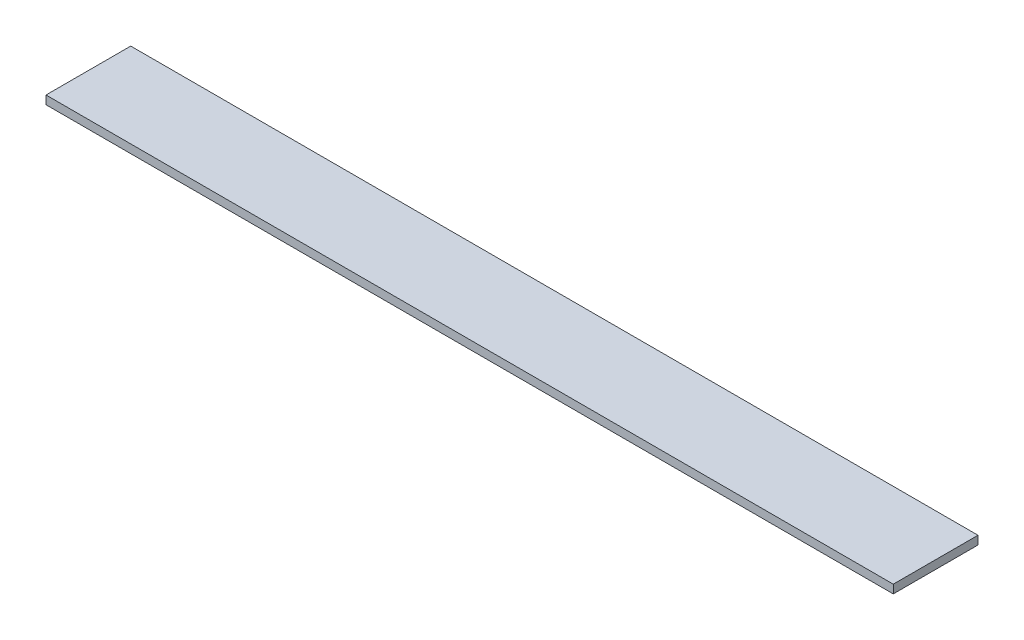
ISO-10303-21;
HEADER;
FILE_DESCRIPTION(('STEP AP214'),'2;1');
FILE_NAME('part.step','',(''),(''),'','','');
FILE_SCHEMA(('AUTOMOTIVE_DESIGN { 1 0 10303 214 1 1 1 1 }'));
ENDSEC;
DATA;
#1=APPLICATION_CONTEXT('core data for automotive mechanical design processes');
#2=APPLICATION_PROTOCOL_DEFINITION('international standard','automotive_design',2000,#1);
#3=PRODUCT_CONTEXT('',#1,'mechanical');
#4=PRODUCT('Part','Part','',(#3));
#5=PRODUCT_RELATED_PRODUCT_CATEGORY('part','',(#4));
#6=PRODUCT_DEFINITION_FORMATION('','',#4);
#7=PRODUCT_DEFINITION_CONTEXT('part definition',#1,'design');
#8=PRODUCT_DEFINITION('design','',#6,#7);
#9=PRODUCT_DEFINITION_SHAPE('','',#8);
#10=(LENGTH_UNIT() NAMED_UNIT(*) SI_UNIT(.MILLI.,.METRE.));
#11=(NAMED_UNIT(*) PLANE_ANGLE_UNIT() SI_UNIT($,.RADIAN.));
#12=(NAMED_UNIT(*) SI_UNIT($,.STERADIAN.) SOLID_ANGLE_UNIT());
#13=UNCERTAINTY_MEASURE_WITH_UNIT(LENGTH_MEASURE(1.E-05),#10,'distance_accuracy_value','');
#14=(GEOMETRIC_REPRESENTATION_CONTEXT(3) GLOBAL_UNCERTAINTY_ASSIGNED_CONTEXT((#13)) GLOBAL_UNIT_ASSIGNED_CONTEXT((#10,
#11,#12)) REPRESENTATION_CONTEXT('',''));
#15=CARTESIAN_POINT('',(0.,0.,0.));
#16=DIRECTION('',(0.,0.,1.));
#17=DIRECTION('',(1.,0.,0.));
#18=AXIS2_PLACEMENT_3D('',#15,#16,#17);
#19=CARTESIAN_POINT('',(499.999999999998,-4.99999999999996,50.));
#20=DIRECTION('',(-1.,0.,0.));
#21=DIRECTION('',(0.,0.,1.));
#22=AXIS2_PLACEMENT_3D('',#19,#20,#21);
#23=PLANE('',#22);
#24=DIRECTION('',(0.,1.,0.));
#25=VECTOR('',#24,1.);
#26=CARTESIAN_POINT('',(499.999999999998,-4.99999999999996,-50.));
#27=LINE('',#26,#25);
#28=CARTESIAN_POINT('',(499.999999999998,-4.99999999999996,-50.));
#29=VERTEX_POINT('',#28);
#30=CARTESIAN_POINT('',(499.999999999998,5.00000000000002,-50.));
#31=VERTEX_POINT('',#30);
#32=EDGE_CURVE('E107',#29,#31,#27,.T.);
#33=ORIENTED_EDGE('',*,*,#32,.T.);
#34=DIRECTION('',(0.,0.,-1.));
#35=VECTOR('',#34,1.);
#36=CARTESIAN_POINT('',(499.999999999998,5.00000000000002,50.));
#37=LINE('',#36,#35);
#38=CARTESIAN_POINT('',(499.999999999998,5.00000000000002,50.));
#39=VERTEX_POINT('',#38);
#40=EDGE_CURVE('E11',#39,#31,#37,.T.);
#41=ORIENTED_EDGE('',*,*,#40,.F.);
#42=DIRECTION('',(0.,1.,0.));
#43=VECTOR('',#42,1.);
#44=CARTESIAN_POINT('',(499.999999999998,-4.99999999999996,50.));
#45=LINE('',#44,#43);
#46=CARTESIAN_POINT('',(499.999999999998,-4.99999999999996,50.));
#47=VERTEX_POINT('',#46);
#48=EDGE_CURVE('E89',#47,#39,#45,.T.);
#49=ORIENTED_EDGE('',*,*,#48,.F.);
#50=DIRECTION('',(0.,0.,-1.));
#51=VECTOR('',#50,1.);
#52=CARTESIAN_POINT('',(499.999999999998,-4.99999999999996,50.));
#53=LINE('',#52,#51);
#54=EDGE_CURVE('E103',#47,#29,#53,.T.);
#55=ORIENTED_EDGE('',*,*,#54,.T.);
#56=EDGE_LOOP('',(#33,#41,#49,#55));
#57=FACE_BOUND('',#56,.T.);
#58=ADVANCED_FACE('F37',(#57),#23,.F.);
#59=CARTESIAN_POINT('',(-500.000000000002,5.00000000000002,50.));
#60=DIRECTION('',(0.,-1.,0.));
#61=DIRECTION('',(0.,0.,-1.));
#62=AXIS2_PLACEMENT_3D('',#59,#60,#61);
#63=PLANE('',#62);
#64=DIRECTION('',(-1.,0.,0.));
#65=VECTOR('',#64,1.);
#66=CARTESIAN_POINT('',(-500.000000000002,5.00000000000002,-50.));
#67=LINE('',#66,#65);
#68=CARTESIAN_POINT('',(-500.000000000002,5.00000000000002,-50.));
#69=VERTEX_POINT('',#68);
#70=EDGE_CURVE('E94',#31,#69,#67,.T.);
#71=ORIENTED_EDGE('',*,*,#70,.T.);
#72=DIRECTION('',(0.,0.,-1.));
#73=VECTOR('',#72,1.);
#74=CARTESIAN_POINT('',(-500.000000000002,5.00000000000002,50.));
#75=LINE('',#74,#73);
#76=CARTESIAN_POINT('',(-500.000000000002,5.00000000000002,50.));
#77=VERTEX_POINT('',#76);
#78=EDGE_CURVE('E46',#77,#69,#75,.T.);
#79=ORIENTED_EDGE('',*,*,#78,.F.);
#80=DIRECTION('',(-1.,0.,0.));
#81=VECTOR('',#80,1.);
#82=CARTESIAN_POINT('',(-500.000000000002,5.00000000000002,50.));
#83=LINE('',#82,#81);
#84=EDGE_CURVE('E84',#39,#77,#83,.T.);
#85=ORIENTED_EDGE('',*,*,#84,.F.);
#86=ORIENTED_EDGE('',*,*,#40,.T.);
#87=EDGE_LOOP('',(#71,#79,#85,#86));
#88=FACE_BOUND('',#87,.T.);
#89=ADVANCED_FACE('F93',(#88),#63,.F.);
#90=CARTESIAN_POINT('',(-500.000000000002,-4.99999999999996,50.));
#91=DIRECTION('',(1.,0.,0.));
#92=DIRECTION('',(0.,0.,-1.));
#93=AXIS2_PLACEMENT_3D('',#90,#91,#92);
#94=PLANE('',#93);
#95=DIRECTION('',(0.,-1.,0.));
#96=VECTOR('',#95,1.);
#97=CARTESIAN_POINT('',(-500.000000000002,-4.99999999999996,-50.));
#98=LINE('',#97,#96);
#99=CARTESIAN_POINT('',(-500.000000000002,-4.99999999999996,-50.));
#100=VERTEX_POINT('',#99);
#101=EDGE_CURVE('E71',#69,#100,#98,.T.);
#102=ORIENTED_EDGE('',*,*,#101,.T.);
#103=DIRECTION('',(0.,0.,-1.));
#104=VECTOR('',#103,1.);
#105=CARTESIAN_POINT('',(-500.000000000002,-4.99999999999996,50.));
#106=LINE('',#105,#104);
#107=CARTESIAN_POINT('',(-500.000000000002,-4.99999999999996,50.));
#108=VERTEX_POINT('',#107);
#109=EDGE_CURVE('E96',#108,#100,#106,.T.);
#110=ORIENTED_EDGE('',*,*,#109,.F.);
#111=DIRECTION('',(0.,-1.,0.));
#112=VECTOR('',#111,1.);
#113=CARTESIAN_POINT('',(-500.000000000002,-4.99999999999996,50.));
#114=LINE('',#113,#112);
#115=EDGE_CURVE('E87',#77,#108,#114,.T.);
#116=ORIENTED_EDGE('',*,*,#115,.F.);
#117=ORIENTED_EDGE('',*,*,#78,.T.);
#118=EDGE_LOOP('',(#102,#110,#116,#117));
#119=FACE_BOUND('',#118,.T.);
#120=ADVANCED_FACE('F97',(#119),#94,.F.);
#121=CARTESIAN_POINT('',(-500.000000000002,-4.99999999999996,50.));
#122=DIRECTION('',(0.,1.,0.));
#123=DIRECTION('',(0.,0.,1.));
#124=AXIS2_PLACEMENT_3D('',#121,#122,#123);
#125=PLANE('',#124);
#126=DIRECTION('',(1.,0.,0.));
#127=VECTOR('',#126,1.);
#128=CARTESIAN_POINT('',(-500.000000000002,-4.99999999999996,-50.));
#129=LINE('',#128,#127);
#130=EDGE_CURVE('E77',#100,#29,#129,.T.);
#131=ORIENTED_EDGE('',*,*,#130,.T.);
#132=ORIENTED_EDGE('',*,*,#54,.F.);
#133=DIRECTION('',(1.,0.,0.));
#134=VECTOR('',#133,1.);
#135=CARTESIAN_POINT('',(-500.000000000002,-4.99999999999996,50.));
#136=LINE('',#135,#134);
#137=EDGE_CURVE('E54',#108,#47,#136,.T.);
#138=ORIENTED_EDGE('',*,*,#137,.F.);
#139=ORIENTED_EDGE('',*,*,#109,.T.);
#140=EDGE_LOOP('',(#131,#132,#138,#139));
#141=FACE_BOUND('',#140,.T.);
#142=ADVANCED_FACE('F119',(#141),#125,.F.);
#143=CARTESIAN_POINT('',(0.,0.,50.));
#144=DIRECTION('',(0.,0.,-1.));
#145=DIRECTION('',(-1.,0.,0.));
#146=AXIS2_PLACEMENT_3D('',#143,#144,#145);
#147=PLANE('',#146);
#148=ORIENTED_EDGE('',*,*,#48,.T.);
#149=ORIENTED_EDGE('',*,*,#84,.T.);
#150=ORIENTED_EDGE('',*,*,#115,.T.);
#151=ORIENTED_EDGE('',*,*,#137,.T.);
#152=EDGE_LOOP('',(#148,#149,#150,#151));
#153=FACE_BOUND('',#152,.T.);
#154=ADVANCED_FACE('F85',(#153),#147,.F.);
#155=CARTESIAN_POINT('',(0.,0.,-50.));
#156=DIRECTION('',(0.,0.,-1.));
#157=DIRECTION('',(-1.,0.,0.));
#158=AXIS2_PLACEMENT_3D('',#155,#156,#157);
#159=PLANE('',#158);
#160=ORIENTED_EDGE('',*,*,#32,.F.);
#161=ORIENTED_EDGE('',*,*,#130,.F.);
#162=ORIENTED_EDGE('',*,*,#101,.F.);
#163=ORIENTED_EDGE('',*,*,#70,.F.);
#164=EDGE_LOOP('',(#160,#161,#162,#163));
#165=FACE_BOUND('',#164,.T.);
#166=ADVANCED_FACE('F122',(#165),#159,.T.);
#167=CLOSED_SHELL('',(#58,#89,#120,#142,#154,#166));
#168=MANIFOLD_SOLID_BREP('B2',#167);
#169=ADVANCED_BREP_SHAPE_REPRESENTATION('',(#18,#168),#14);
#170=SHAPE_DEFINITION_REPRESENTATION(#9,#169);
ENDSEC;
END-ISO-10303-21;
